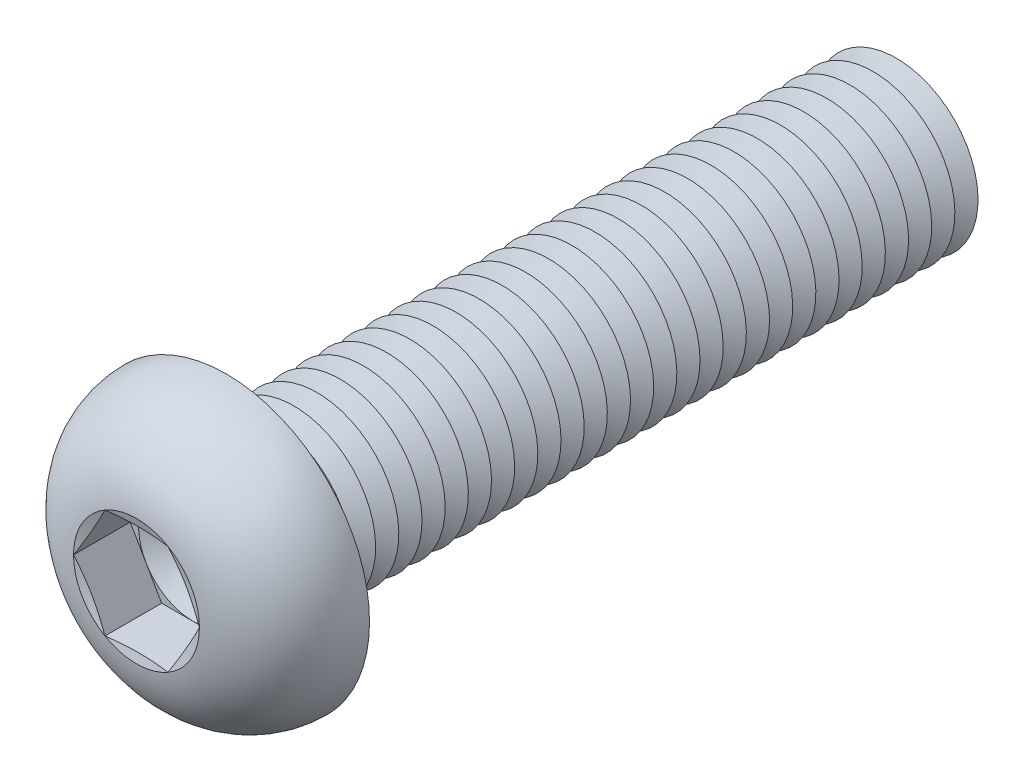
from build123d import *

# Parameters (mm, degrees)
FILLET1_R          = 0.85
LPATTERN1_COUNT    = 29
LPATTERN1_PITCH    = 1.7
CUT_EXTRUDE1_DEPTH = 4.16


with BuildPart() as part:
    # Sketch1 → Revolve1 (revolve)
    with BuildSketch(Plane(origin=(0, 0, 0), x_dir=(0, 0, -1), z_dir=(1, 0, 0))):
        with BuildLine():
            Line((0, 6), (0, 10.5))
            ThreePointArc((0, 10.5), (-4.420082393, 8.816378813), (-6.6, 4.6188))
            Line((-6.6, 4.6188), (-5.981198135, 2.3094))
            Line((-5.981198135, 2.3094), (-6.6, 2.3094))
            Line((-6.6, 2.3094), (-6.6, 0))
            Line((-6.6, 0), (50, 0))
            Line((50, 0), (50, 6))
            Line((50, 6), (0, 6))
        make_face()
    revolve(axis=Axis((0, 0, -50), (0, 0, 1)))

    # Fillet1
    fillet1_edges = [part.edges().sort_by_distance(p)[0] for p in [
        (0, -6, 0),
    ]]
    fillet(fillet1_edges, radius=FILLET1_R)

    # Sketch2 → Cut-Revolve1 (revolve, cut)
    with BuildSketch(Plane(origin=(0, 0, 0), x_dir=(0, 0, -1), z_dir=(1, 0, 0))):
        Polygon((49.15, 6), (50.85, 6), (50, 4.527756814), align=None)
    cut_revolve1 = revolve(axis=Axis((0, 0, -50), (0, 0, -1)), mode=Mode.SUBTRACT)

    # LPattern1: Cut-Revolve1 ×29
    with Locations(*[(0, 0, i * LPATTERN1_PITCH) for i in range(1, LPATTERN1_COUNT)]):
        add(cut_revolve1, mode=Mode.SUBTRACT)

    # Sketch3 → Cut-Extrude1 (cut)
    with BuildSketch(Plane.XY.offset(6.6)):
        Polygon((2.3094, 3.999998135), (-2.3094, 3.999998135), (-4.6188, 0), (-2.3094, -3.999998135), (2.3094, -3.999998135), (4.6188, 0), align=None)
    extrude(amount=-CUT_EXTRUDE1_DEPTH, mode=Mode.SUBTRACT)

    # Cut-Extrude2 cone 1 section (on through the dimple's axis) → Cut-Extrude2 (revolve, cut)
    with BuildSketch(Plane(origin=(0, 0, 2.44), x_dir=(0, -1, 0), z_dir=(1, 0, 0))):
        Polygon((0, 0), (3.999998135, 0), (0, 2.3094), align=None)
    revolve(axis=Axis((0, 0, 2.44), (0, 0, -1)), mode=Mode.SUBTRACT)


solid = part.part
